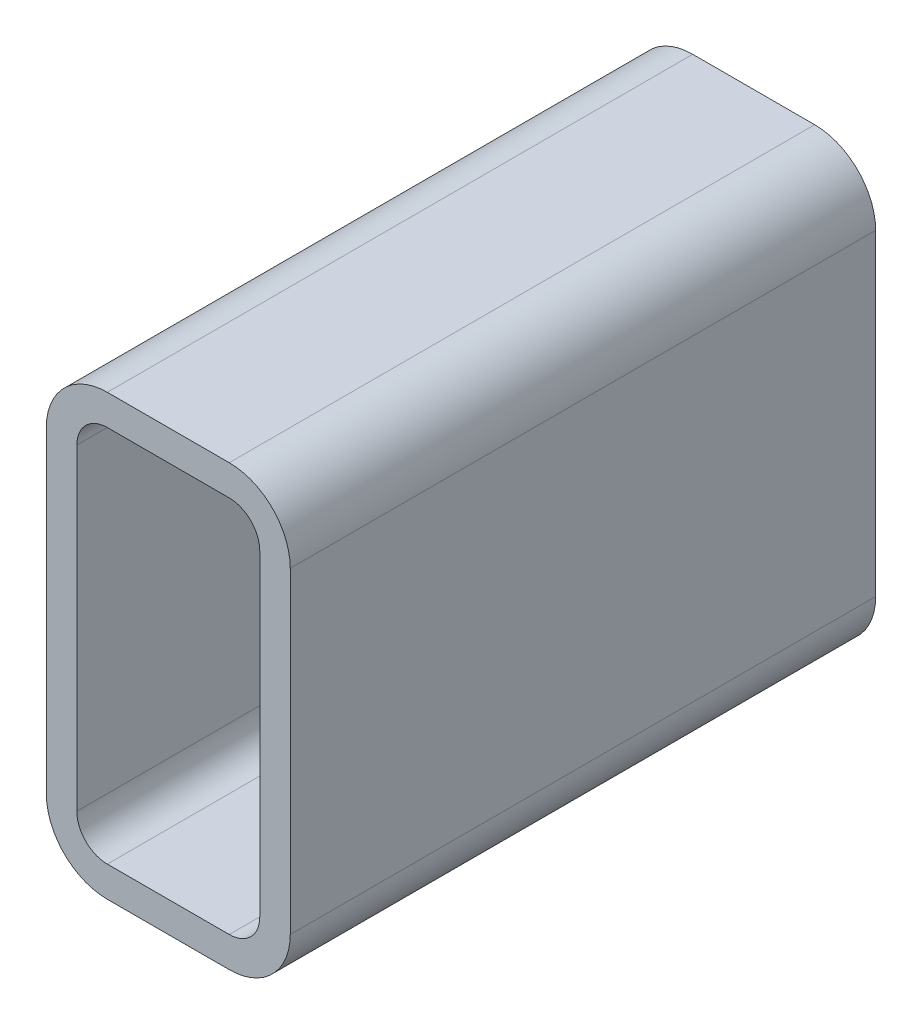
ISO-10303-21;
HEADER;
FILE_DESCRIPTION(('STEP AP214'),'2;1');
FILE_NAME('part.step','',(''),(''),'','','');
FILE_SCHEMA(('AUTOMOTIVE_DESIGN { 1 0 10303 214 1 1 1 1 }'));
ENDSEC;
DATA;
#1=APPLICATION_CONTEXT('core data for automotive mechanical design processes');
#2=APPLICATION_PROTOCOL_DEFINITION('international standard','automotive_design',2000,#1);
#3=PRODUCT_CONTEXT('',#1,'mechanical');
#4=PRODUCT('Part','Part','',(#3));
#5=PRODUCT_RELATED_PRODUCT_CATEGORY('part','',(#4));
#6=PRODUCT_DEFINITION_FORMATION('','',#4);
#7=PRODUCT_DEFINITION_CONTEXT('part definition',#1,'design');
#8=PRODUCT_DEFINITION('design','',#6,#7);
#9=PRODUCT_DEFINITION_SHAPE('','',#8);
#10=(LENGTH_UNIT() NAMED_UNIT(*) SI_UNIT(.MILLI.,.METRE.));
#11=(NAMED_UNIT(*) PLANE_ANGLE_UNIT() SI_UNIT($,.RADIAN.));
#12=(NAMED_UNIT(*) SI_UNIT($,.STERADIAN.) SOLID_ANGLE_UNIT());
#13=UNCERTAINTY_MEASURE_WITH_UNIT(LENGTH_MEASURE(1.E-05),#10,'distance_accuracy_value','');
#14=(GEOMETRIC_REPRESENTATION_CONTEXT(3) GLOBAL_UNCERTAINTY_ASSIGNED_CONTEXT((#13)) GLOBAL_UNIT_ASSIGNED_CONTEXT((#10,
#11,#12)) REPRESENTATION_CONTEXT('',''));
#15=CARTESIAN_POINT('',(0.,0.,0.));
#16=DIRECTION('',(0.,0.,1.));
#17=DIRECTION('',(1.,0.,0.));
#18=AXIS2_PLACEMENT_3D('',#15,#16,#17);
#19=CARTESIAN_POINT('',(32.6112396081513,198.793222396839,304.8));
#20=DIRECTION('',(0.,0.,1.));
#21=DIRECTION('',(1.,0.,0.));
#22=AXIS2_PLACEMENT_3D('',#19,#20,#21);
#23=PLANE('',#22);
#24=CARTESIAN_POINT('',(32.6112396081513,198.793222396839,304.8));
#25=DIRECTION('',(0.,0.,1.));
#26=DIRECTION('',(1.,0.,0.));
#27=AXIS2_PLACEMENT_3D('',#24,#25,#26);
#28=CIRCLE('',#27,31.75);
#29=CARTESIAN_POINT('',(32.6112396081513,230.543222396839,304.8));
#30=VERTEX_POINT('',#29);
#31=CARTESIAN_POINT('',(0.8612396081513,198.793222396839,304.8));
#32=VERTEX_POINT('',#31);
#33=EDGE_CURVE('E211',#30,#32,#28,.T.);
#34=ORIENTED_EDGE('',*,*,#33,.T.);
#35=DIRECTION('',(0.,-1.,0.));
#36=VECTOR('',#35,1.);
#37=CARTESIAN_POINT('',(0.8612396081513,198.793222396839,304.8));
#38=LINE('',#37,#36);
#39=CARTESIAN_POINT('',(0.8612396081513,33.6932223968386,304.8));
#40=VERTEX_POINT('',#39);
#41=EDGE_CURVE('E214',#32,#40,#38,.T.);
#42=ORIENTED_EDGE('',*,*,#41,.T.);
#43=CARTESIAN_POINT('',(32.6112396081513,33.6932223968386,304.8));
#44=DIRECTION('',(0.,0.,1.));
#45=DIRECTION('',(1.,0.,0.));
#46=AXIS2_PLACEMENT_3D('',#43,#44,#45);
#47=CIRCLE('',#46,31.75);
#48=CARTESIAN_POINT('',(32.6112396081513,1.94322239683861,304.8));
#49=VERTEX_POINT('',#48);
#50=EDGE_CURVE('E217',#40,#49,#47,.T.);
#51=ORIENTED_EDGE('',*,*,#50,.T.);
#52=DIRECTION('',(1.,0.,0.));
#53=VECTOR('',#52,1.);
#54=CARTESIAN_POINT('',(32.6112396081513,1.94322239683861,304.8));
#55=LINE('',#54,#53);
#56=CARTESIAN_POINT('',(96.1112396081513,1.94322239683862,304.8));
#57=VERTEX_POINT('',#56);
#58=EDGE_CURVE('E219',#49,#57,#55,.T.);
#59=ORIENTED_EDGE('',*,*,#58,.T.);
#60=CARTESIAN_POINT('',(96.1112396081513,33.6932223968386,304.8));
#61=DIRECTION('',(0.,0.,1.));
#62=DIRECTION('',(1.,0.,0.));
#63=AXIS2_PLACEMENT_3D('',#60,#61,#62);
#64=CIRCLE('',#63,31.75);
#65=CARTESIAN_POINT('',(127.861239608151,33.6932223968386,304.8));
#66=VERTEX_POINT('',#65);
#67=EDGE_CURVE('E221',#57,#66,#64,.T.);
#68=ORIENTED_EDGE('',*,*,#67,.T.);
#69=DIRECTION('',(0.,1.,0.));
#70=VECTOR('',#69,1.);
#71=CARTESIAN_POINT('',(127.861239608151,33.6932223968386,304.8));
#72=LINE('',#71,#70);
#73=CARTESIAN_POINT('',(127.861239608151,198.793222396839,304.8));
#74=VERTEX_POINT('',#73);
#75=EDGE_CURVE('E223',#66,#74,#72,.T.);
#76=ORIENTED_EDGE('',*,*,#75,.T.);
#77=CARTESIAN_POINT('',(96.1112396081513,198.793222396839,304.8));
#78=DIRECTION('',(0.,0.,1.));
#79=DIRECTION('',(1.,0.,0.));
#80=AXIS2_PLACEMENT_3D('',#77,#78,#79);
#81=CIRCLE('',#80,31.75);
#82=CARTESIAN_POINT('',(96.1112396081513,230.543222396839,304.8));
#83=VERTEX_POINT('',#82);
#84=EDGE_CURVE('E225',#74,#83,#81,.T.);
#85=ORIENTED_EDGE('',*,*,#84,.T.);
#86=DIRECTION('',(-1.,0.,0.));
#87=VECTOR('',#86,1.);
#88=CARTESIAN_POINT('',(96.1112396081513,230.543222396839,304.8));
#89=LINE('',#88,#87);
#90=EDGE_CURVE('E227',#83,#30,#89,.T.);
#91=ORIENTED_EDGE('',*,*,#90,.T.);
#92=EDGE_LOOP('',(#34,#42,#51,#59,#68,#76,#85,#91));
#93=FACE_BOUND('',#92,.T.);
#94=DIRECTION('',(0.,-1.,0.));
#95=VECTOR('',#94,1.);
#96=CARTESIAN_POINT('',(16.7362396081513,33.6932223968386,304.8));
#97=LINE('',#96,#95);
#98=CARTESIAN_POINT('',(16.7362396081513,198.793222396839,304.8));
#99=VERTEX_POINT('',#98);
#100=CARTESIAN_POINT('',(16.7362396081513,33.6932223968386,304.8));
#101=VERTEX_POINT('',#100);
#102=EDGE_CURVE('E154',#99,#101,#97,.T.);
#103=ORIENTED_EDGE('',*,*,#102,.F.);
#104=CARTESIAN_POINT('',(32.6112396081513,198.793222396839,304.8));
#105=DIRECTION('',(0.,0.,1.));
#106=DIRECTION('',(1.,0.,0.));
#107=AXIS2_PLACEMENT_3D('',#104,#105,#106);
#108=CIRCLE('',#107,15.875);
#109=CARTESIAN_POINT('',(32.6112396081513,214.668222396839,304.8));
#110=VERTEX_POINT('',#109);
#111=EDGE_CURVE('E146',#110,#99,#108,.T.);
#112=ORIENTED_EDGE('',*,*,#111,.F.);
#113=DIRECTION('',(-1.,0.,0.));
#114=VECTOR('',#113,1.);
#115=CARTESIAN_POINT('',(32.6112396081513,214.668222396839,304.8));
#116=LINE('',#115,#114);
#117=CARTESIAN_POINT('',(96.1112396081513,214.668222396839,304.8));
#118=VERTEX_POINT('',#117);
#119=EDGE_CURVE('E179',#118,#110,#116,.T.);
#120=ORIENTED_EDGE('',*,*,#119,.F.);
#121=CARTESIAN_POINT('',(96.1112396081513,198.793222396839,304.8));
#122=DIRECTION('',(0.,0.,1.));
#123=DIRECTION('',(1.,0.,0.));
#124=AXIS2_PLACEMENT_3D('',#121,#122,#123);
#125=CIRCLE('',#124,15.875);
#126=CARTESIAN_POINT('',(111.986239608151,198.793222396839,304.8));
#127=VERTEX_POINT('',#126);
#128=EDGE_CURVE('E177',#127,#118,#125,.T.);
#129=ORIENTED_EDGE('',*,*,#128,.F.);
#130=DIRECTION('',(0.,1.,0.));
#131=VECTOR('',#130,1.);
#132=CARTESIAN_POINT('',(111.986239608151,198.793222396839,304.8));
#133=LINE('',#132,#131);
#134=CARTESIAN_POINT('',(111.986239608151,33.6932223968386,304.8));
#135=VERTEX_POINT('',#134);
#136=EDGE_CURVE('E175',#135,#127,#133,.T.);
#137=ORIENTED_EDGE('',*,*,#136,.F.);
#138=CARTESIAN_POINT('',(96.1112396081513,33.6932223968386,304.8));
#139=DIRECTION('',(0.,0.,1.));
#140=DIRECTION('',(1.,0.,0.));
#141=AXIS2_PLACEMENT_3D('',#138,#139,#140);
#142=CIRCLE('',#141,15.875);
#143=CARTESIAN_POINT('',(96.1112396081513,17.8182223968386,304.8));
#144=VERTEX_POINT('',#143);
#145=EDGE_CURVE('E173',#144,#135,#142,.T.);
#146=ORIENTED_EDGE('',*,*,#145,.F.);
#147=DIRECTION('',(1.,0.,0.));
#148=VECTOR('',#147,1.);
#149=CARTESIAN_POINT('',(96.1112396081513,17.8182223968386,304.8));
#150=LINE('',#149,#148);
#151=CARTESIAN_POINT('',(32.6112396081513,17.8182223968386,304.8));
#152=VERTEX_POINT('',#151);
#153=EDGE_CURVE('E169',#152,#144,#150,.T.);
#154=ORIENTED_EDGE('',*,*,#153,.F.);
#155=CARTESIAN_POINT('',(32.6112396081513,33.6932223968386,304.8));
#156=DIRECTION('',(0.,0.,1.));
#157=DIRECTION('',(1.,0.,0.));
#158=AXIS2_PLACEMENT_3D('',#155,#156,#157);
#159=CIRCLE('',#158,15.875);
#160=EDGE_CURVE('E167',#101,#152,#159,.T.);
#161=ORIENTED_EDGE('',*,*,#160,.F.);
#162=EDGE_LOOP('',(#103,#112,#120,#129,#137,#146,#154,#161));
#163=FACE_BOUND('',#162,.T.);
#164=ADVANCED_FACE('F33',(#93,#163),#23,.T.);
#165=CARTESIAN_POINT('',(32.6112396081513,198.793222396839,0.));
#166=DIRECTION('',(0.,0.,1.));
#167=DIRECTION('',(1.,0.,0.));
#168=AXIS2_PLACEMENT_3D('',#165,#166,#167);
#169=PLANE('',#168);
#170=CARTESIAN_POINT('',(32.6112396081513,198.793222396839,0.));
#171=DIRECTION('',(0.,0.,1.));
#172=DIRECTION('',(1.,0.,0.));
#173=AXIS2_PLACEMENT_3D('',#170,#171,#172);
#174=CIRCLE('',#173,31.75);
#175=CARTESIAN_POINT('',(32.6112396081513,230.543222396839,0.));
#176=VERTEX_POINT('',#175);
#177=CARTESIAN_POINT('',(0.8612396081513,198.793222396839,0.));
#178=VERTEX_POINT('',#177);
#179=EDGE_CURVE('E162',#176,#178,#174,.T.);
#180=ORIENTED_EDGE('',*,*,#179,.F.);
#181=DIRECTION('',(-1.,0.,0.));
#182=VECTOR('',#181,1.);
#183=CARTESIAN_POINT('',(96.1112396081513,230.543222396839,0.));
#184=LINE('',#183,#182);
#185=CARTESIAN_POINT('',(96.1112396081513,230.543222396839,0.));
#186=VERTEX_POINT('',#185);
#187=EDGE_CURVE('E215',#186,#176,#184,.T.);
#188=ORIENTED_EDGE('',*,*,#187,.F.);
#189=CARTESIAN_POINT('',(96.1112396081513,198.793222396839,0.));
#190=DIRECTION('',(0.,0.,1.));
#191=DIRECTION('',(1.,0.,0.));
#192=AXIS2_PLACEMENT_3D('',#189,#190,#191);
#193=CIRCLE('',#192,31.75);
#194=CARTESIAN_POINT('',(127.861239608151,198.793222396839,0.));
#195=VERTEX_POINT('',#194);
#196=EDGE_CURVE('E242',#195,#186,#193,.T.);
#197=ORIENTED_EDGE('',*,*,#196,.F.);
#198=DIRECTION('',(0.,1.,0.));
#199=VECTOR('',#198,1.);
#200=CARTESIAN_POINT('',(127.861239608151,33.6932223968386,0.));
#201=LINE('',#200,#199);
#202=CARTESIAN_POINT('',(127.861239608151,33.6932223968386,0.));
#203=VERTEX_POINT('',#202);
#204=EDGE_CURVE('E240',#203,#195,#201,.T.);
#205=ORIENTED_EDGE('',*,*,#204,.F.);
#206=CARTESIAN_POINT('',(96.1112396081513,33.6932223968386,0.));
#207=DIRECTION('',(0.,0.,1.));
#208=DIRECTION('',(1.,0.,0.));
#209=AXIS2_PLACEMENT_3D('',#206,#207,#208);
#210=CIRCLE('',#209,31.75);
#211=CARTESIAN_POINT('',(96.1112396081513,1.94322239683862,0.));
#212=VERTEX_POINT('',#211);
#213=EDGE_CURVE('E238',#212,#203,#210,.T.);
#214=ORIENTED_EDGE('',*,*,#213,.F.);
#215=DIRECTION('',(1.,0.,0.));
#216=VECTOR('',#215,1.);
#217=CARTESIAN_POINT('',(32.6112396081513,1.94322239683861,0.));
#218=LINE('',#217,#216);
#219=CARTESIAN_POINT('',(32.6112396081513,1.94322239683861,0.));
#220=VERTEX_POINT('',#219);
#221=EDGE_CURVE('E236',#220,#212,#218,.T.);
#222=ORIENTED_EDGE('',*,*,#221,.F.);
#223=CARTESIAN_POINT('',(32.6112396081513,33.6932223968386,0.));
#224=DIRECTION('',(0.,0.,1.));
#225=DIRECTION('',(1.,0.,0.));
#226=AXIS2_PLACEMENT_3D('',#223,#224,#225);
#227=CIRCLE('',#226,31.75);
#228=CARTESIAN_POINT('',(0.8612396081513,33.6932223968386,0.));
#229=VERTEX_POINT('',#228);
#230=EDGE_CURVE('E234',#229,#220,#227,.T.);
#231=ORIENTED_EDGE('',*,*,#230,.F.);
#232=DIRECTION('',(0.,-1.,0.));
#233=VECTOR('',#232,1.);
#234=CARTESIAN_POINT('',(0.8612396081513,198.793222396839,0.));
#235=LINE('',#234,#233);
#236=EDGE_CURVE('E232',#178,#229,#235,.T.);
#237=ORIENTED_EDGE('',*,*,#236,.F.);
#238=EDGE_LOOP('',(#180,#188,#197,#205,#214,#222,#231,#237));
#239=FACE_BOUND('',#238,.T.);
#240=CARTESIAN_POINT('',(32.6112396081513,198.793222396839,0.));
#241=DIRECTION('',(0.,0.,1.));
#242=DIRECTION('',(1.,0.,0.));
#243=AXIS2_PLACEMENT_3D('',#240,#241,#242);
#244=CIRCLE('',#243,15.875);
#245=CARTESIAN_POINT('',(32.6112396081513,214.668222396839,0.));
#246=VERTEX_POINT('',#245);
#247=CARTESIAN_POINT('',(16.7362396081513,198.793222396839,0.));
#248=VERTEX_POINT('',#247);
#249=EDGE_CURVE('E56',#246,#248,#244,.T.);
#250=ORIENTED_EDGE('',*,*,#249,.T.);
#251=DIRECTION('',(0.,-1.,0.));
#252=VECTOR('',#251,1.);
#253=CARTESIAN_POINT('',(16.7362396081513,33.6932223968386,0.));
#254=LINE('',#253,#252);
#255=CARTESIAN_POINT('',(16.7362396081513,33.6932223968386,0.));
#256=VERTEX_POINT('',#255);
#257=EDGE_CURVE('E161',#248,#256,#254,.T.);
#258=ORIENTED_EDGE('',*,*,#257,.T.);
#259=CARTESIAN_POINT('',(32.6112396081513,33.6932223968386,0.));
#260=DIRECTION('',(0.,0.,1.));
#261=DIRECTION('',(1.,0.,0.));
#262=AXIS2_PLACEMENT_3D('',#259,#260,#261);
#263=CIRCLE('',#262,15.875);
#264=CARTESIAN_POINT('',(32.6112396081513,17.8182223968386,0.));
#265=VERTEX_POINT('',#264);
#266=EDGE_CURVE('E183',#256,#265,#263,.T.);
#267=ORIENTED_EDGE('',*,*,#266,.T.);
#268=DIRECTION('',(1.,0.,0.));
#269=VECTOR('',#268,1.);
#270=CARTESIAN_POINT('',(96.1112396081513,17.8182223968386,0.));
#271=LINE('',#270,#269);
#272=CARTESIAN_POINT('',(96.1112396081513,17.8182223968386,0.));
#273=VERTEX_POINT('',#272);
#274=EDGE_CURVE('E186',#265,#273,#271,.T.);
#275=ORIENTED_EDGE('',*,*,#274,.T.);
#276=CARTESIAN_POINT('',(96.1112396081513,33.6932223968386,0.));
#277=DIRECTION('',(0.,0.,1.));
#278=DIRECTION('',(1.,0.,0.));
#279=AXIS2_PLACEMENT_3D('',#276,#277,#278);
#280=CIRCLE('',#279,15.875);
#281=CARTESIAN_POINT('',(111.986239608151,33.6932223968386,0.));
#282=VERTEX_POINT('',#281);
#283=EDGE_CURVE('E189',#273,#282,#280,.T.);
#284=ORIENTED_EDGE('',*,*,#283,.T.);
#285=DIRECTION('',(0.,1.,0.));
#286=VECTOR('',#285,1.);
#287=CARTESIAN_POINT('',(111.986239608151,198.793222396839,0.));
#288=LINE('',#287,#286);
#289=CARTESIAN_POINT('',(111.986239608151,198.793222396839,0.));
#290=VERTEX_POINT('',#289);
#291=EDGE_CURVE('E192',#282,#290,#288,.T.);
#292=ORIENTED_EDGE('',*,*,#291,.T.);
#293=CARTESIAN_POINT('',(96.1112396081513,198.793222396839,0.));
#294=DIRECTION('',(0.,0.,1.));
#295=DIRECTION('',(1.,0.,0.));
#296=AXIS2_PLACEMENT_3D('',#293,#294,#295);
#297=CIRCLE('',#296,15.875);
#298=CARTESIAN_POINT('',(96.1112396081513,214.668222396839,0.));
#299=VERTEX_POINT('',#298);
#300=EDGE_CURVE('E195',#290,#299,#297,.T.);
#301=ORIENTED_EDGE('',*,*,#300,.T.);
#302=DIRECTION('',(-1.,0.,0.));
#303=VECTOR('',#302,1.);
#304=CARTESIAN_POINT('',(32.6112396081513,214.668222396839,0.));
#305=LINE('',#304,#303);
#306=EDGE_CURVE('E155',#299,#246,#305,.T.);
#307=ORIENTED_EDGE('',*,*,#306,.T.);
#308=EDGE_LOOP('',(#250,#258,#267,#275,#284,#292,#301,#307));
#309=FACE_BOUND('',#308,.T.);
#310=ADVANCED_FACE('F272',(#239,#309),#169,.F.);
#311=CARTESIAN_POINT('',(32.6112396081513,198.793222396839,304.8));
#312=DIRECTION('',(0.,0.,-1.));
#313=DIRECTION('',(-1.,0.,0.));
#314=AXIS2_PLACEMENT_3D('',#311,#312,#313);
#315=CYLINDRICAL_SURFACE('',#314,31.75);
#316=ORIENTED_EDGE('',*,*,#179,.T.);
#317=DIRECTION('',(0.,0.,-1.));
#318=VECTOR('',#317,1.);
#319=CARTESIAN_POINT('',(0.8612396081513,198.793222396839,304.8));
#320=LINE('',#319,#318);
#321=EDGE_CURVE('E11',#32,#178,#320,.T.);
#322=ORIENTED_EDGE('',*,*,#321,.F.);
#323=ORIENTED_EDGE('',*,*,#33,.F.);
#324=DIRECTION('',(0.,0.,-1.));
#325=VECTOR('',#324,1.);
#326=CARTESIAN_POINT('',(32.6112396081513,230.543222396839,304.8));
#327=LINE('',#326,#325);
#328=EDGE_CURVE('E229',#30,#176,#327,.T.);
#329=ORIENTED_EDGE('',*,*,#328,.T.);
#330=EDGE_LOOP('',(#316,#322,#323,#329));
#331=FACE_BOUND('',#330,.T.);
#332=ADVANCED_FACE('F35',(#331),#315,.T.);
#333=CARTESIAN_POINT('',(0.8612396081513,198.793222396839,304.8));
#334=DIRECTION('',(1.,0.,0.));
#335=DIRECTION('',(0.,0.,-1.));
#336=AXIS2_PLACEMENT_3D('',#333,#334,#335);
#337=PLANE('',#336);
#338=ORIENTED_EDGE('',*,*,#236,.T.);
#339=DIRECTION('',(0.,0.,-1.));
#340=VECTOR('',#339,1.);
#341=CARTESIAN_POINT('',(0.8612396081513,33.6932223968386,304.8));
#342=LINE('',#341,#340);
#343=EDGE_CURVE('E41',#40,#229,#342,.T.);
#344=ORIENTED_EDGE('',*,*,#343,.F.);
#345=ORIENTED_EDGE('',*,*,#41,.F.);
#346=ORIENTED_EDGE('',*,*,#321,.T.);
#347=EDGE_LOOP('',(#338,#344,#345,#346));
#348=FACE_BOUND('',#347,.T.);
#349=ADVANCED_FACE('F289',(#348),#337,.F.);
#350=CARTESIAN_POINT('',(32.6112396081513,33.6932223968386,304.8));
#351=DIRECTION('',(0.,0.,-1.));
#352=DIRECTION('',(-1.,0.,0.));
#353=AXIS2_PLACEMENT_3D('',#350,#351,#352);
#354=CYLINDRICAL_SURFACE('',#353,31.75);
#355=ORIENTED_EDGE('',*,*,#230,.T.);
#356=DIRECTION('',(0.,0.,-1.));
#357=VECTOR('',#356,1.);
#358=CARTESIAN_POINT('',(32.6112396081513,1.94322239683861,304.8));
#359=LINE('',#358,#357);
#360=EDGE_CURVE('E259',#49,#220,#359,.T.);
#361=ORIENTED_EDGE('',*,*,#360,.F.);
#362=ORIENTED_EDGE('',*,*,#50,.F.);
#363=ORIENTED_EDGE('',*,*,#343,.T.);
#364=EDGE_LOOP('',(#355,#361,#362,#363));
#365=FACE_BOUND('',#364,.T.);
#366=ADVANCED_FACE('F266',(#365),#354,.T.);
#367=CARTESIAN_POINT('',(32.6112396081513,1.94322239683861,304.8));
#368=DIRECTION('',(0.,1.,0.));
#369=DIRECTION('',(0.,0.,1.));
#370=AXIS2_PLACEMENT_3D('',#367,#368,#369);
#371=PLANE('',#370);
#372=ORIENTED_EDGE('',*,*,#221,.T.);
#373=DIRECTION('',(0.,0.,-1.));
#374=VECTOR('',#373,1.);
#375=CARTESIAN_POINT('',(96.1112396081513,1.94322239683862,304.8));
#376=LINE('',#375,#374);
#377=EDGE_CURVE('E256',#57,#212,#376,.T.);
#378=ORIENTED_EDGE('',*,*,#377,.F.);
#379=ORIENTED_EDGE('',*,*,#58,.F.);
#380=ORIENTED_EDGE('',*,*,#360,.T.);
#381=EDGE_LOOP('',(#372,#378,#379,#380));
#382=FACE_BOUND('',#381,.T.);
#383=ADVANCED_FACE('F278',(#382),#371,.F.);
#384=CARTESIAN_POINT('',(96.1112396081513,33.6932223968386,304.8));
#385=DIRECTION('',(0.,0.,-1.));
#386=DIRECTION('',(-1.,0.,0.));
#387=AXIS2_PLACEMENT_3D('',#384,#385,#386);
#388=CYLINDRICAL_SURFACE('',#387,31.75);
#389=ORIENTED_EDGE('',*,*,#213,.T.);
#390=DIRECTION('',(0.,0.,-1.));
#391=VECTOR('',#390,1.);
#392=CARTESIAN_POINT('',(127.861239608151,33.6932223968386,304.8));
#393=LINE('',#392,#391);
#394=EDGE_CURVE('E253',#66,#203,#393,.T.);
#395=ORIENTED_EDGE('',*,*,#394,.F.);
#396=ORIENTED_EDGE('',*,*,#67,.F.);
#397=ORIENTED_EDGE('',*,*,#377,.T.);
#398=EDGE_LOOP('',(#389,#395,#396,#397));
#399=FACE_BOUND('',#398,.T.);
#400=ADVANCED_FACE('F282',(#399),#388,.T.);
#401=CARTESIAN_POINT('',(127.861239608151,33.6932223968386,304.8));
#402=DIRECTION('',(-1.,0.,0.));
#403=DIRECTION('',(0.,0.,1.));
#404=AXIS2_PLACEMENT_3D('',#401,#402,#403);
#405=PLANE('',#404);
#406=ORIENTED_EDGE('',*,*,#204,.T.);
#407=DIRECTION('',(0.,0.,-1.));
#408=VECTOR('',#407,1.);
#409=CARTESIAN_POINT('',(127.861239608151,198.793222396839,304.8));
#410=LINE('',#409,#408);
#411=EDGE_CURVE('E250',#74,#195,#410,.T.);
#412=ORIENTED_EDGE('',*,*,#411,.F.);
#413=ORIENTED_EDGE('',*,*,#75,.F.);
#414=ORIENTED_EDGE('',*,*,#394,.T.);
#415=EDGE_LOOP('',(#406,#412,#413,#414));
#416=FACE_BOUND('',#415,.T.);
#417=ADVANCED_FACE('F302',(#416),#405,.F.);
#418=CARTESIAN_POINT('',(96.1112396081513,198.793222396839,304.8));
#419=DIRECTION('',(0.,0.,-1.));
#420=DIRECTION('',(-1.,0.,0.));
#421=AXIS2_PLACEMENT_3D('',#418,#419,#420);
#422=CYLINDRICAL_SURFACE('',#421,31.75);
#423=ORIENTED_EDGE('',*,*,#196,.T.);
#424=DIRECTION('',(0.,0.,-1.));
#425=VECTOR('',#424,1.);
#426=CARTESIAN_POINT('',(96.1112396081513,230.543222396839,304.8));
#427=LINE('',#426,#425);
#428=EDGE_CURVE('E247',#83,#186,#427,.T.);
#429=ORIENTED_EDGE('',*,*,#428,.F.);
#430=ORIENTED_EDGE('',*,*,#84,.F.);
#431=ORIENTED_EDGE('',*,*,#411,.T.);
#432=EDGE_LOOP('',(#423,#429,#430,#431));
#433=FACE_BOUND('',#432,.T.);
#434=ADVANCED_FACE('F300',(#433),#422,.T.);
#435=CARTESIAN_POINT('',(96.1112396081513,230.543222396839,304.8));
#436=DIRECTION('',(0.,-1.,0.));
#437=DIRECTION('',(0.,0.,-1.));
#438=AXIS2_PLACEMENT_3D('',#435,#436,#437);
#439=PLANE('',#438);
#440=ORIENTED_EDGE('',*,*,#187,.T.);
#441=ORIENTED_EDGE('',*,*,#328,.F.);
#442=ORIENTED_EDGE('',*,*,#90,.F.);
#443=ORIENTED_EDGE('',*,*,#428,.T.);
#444=EDGE_LOOP('',(#440,#441,#442,#443));
#445=FACE_BOUND('',#444,.T.);
#446=ADVANCED_FACE('F295',(#445),#439,.F.);
#447=CARTESIAN_POINT('',(32.6112396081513,198.793222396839,304.8));
#448=DIRECTION('',(0.,0.,-1.));
#449=DIRECTION('',(-1.,0.,0.));
#450=AXIS2_PLACEMENT_3D('',#447,#448,#449);
#451=CYLINDRICAL_SURFACE('',#450,15.875);
#452=ORIENTED_EDGE('',*,*,#249,.F.);
#453=DIRECTION('',(0.,0.,-1.));
#454=VECTOR('',#453,1.);
#455=CARTESIAN_POINT('',(32.6112396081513,214.668222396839,304.8));
#456=LINE('',#455,#454);
#457=EDGE_CURVE('E150',#110,#246,#456,.T.);
#458=ORIENTED_EDGE('',*,*,#457,.F.);
#459=ORIENTED_EDGE('',*,*,#111,.T.);
#460=DIRECTION('',(0.,0.,-1.));
#461=VECTOR('',#460,1.);
#462=CARTESIAN_POINT('',(16.7362396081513,198.793222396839,304.8));
#463=LINE('',#462,#461);
#464=EDGE_CURVE('E149',#99,#248,#463,.T.);
#465=ORIENTED_EDGE('',*,*,#464,.T.);
#466=EDGE_LOOP('',(#452,#458,#459,#465));
#467=FACE_BOUND('',#466,.T.);
#468=ADVANCED_FACE('F148',(#467),#451,.F.);
#469=CARTESIAN_POINT('',(16.7362396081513,33.6932223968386,304.8));
#470=DIRECTION('',(1.,0.,0.));
#471=DIRECTION('',(0.,0.,-1.));
#472=AXIS2_PLACEMENT_3D('',#469,#470,#471);
#473=PLANE('',#472);
#474=ORIENTED_EDGE('',*,*,#257,.F.);
#475=ORIENTED_EDGE('',*,*,#464,.F.);
#476=ORIENTED_EDGE('',*,*,#102,.T.);
#477=DIRECTION('',(0.,0.,-1.));
#478=VECTOR('',#477,1.);
#479=CARTESIAN_POINT('',(16.7362396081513,33.6932223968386,304.8));
#480=LINE('',#479,#478);
#481=EDGE_CURVE('E163',#101,#256,#480,.T.);
#482=ORIENTED_EDGE('',*,*,#481,.T.);
#483=EDGE_LOOP('',(#474,#475,#476,#482));
#484=FACE_BOUND('',#483,.T.);
#485=ADVANCED_FACE('F158',(#484),#473,.T.);
#486=CARTESIAN_POINT('',(32.6112396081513,33.6932223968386,304.8));
#487=DIRECTION('',(0.,0.,-1.));
#488=DIRECTION('',(-1.,0.,0.));
#489=AXIS2_PLACEMENT_3D('',#486,#487,#488);
#490=CYLINDRICAL_SURFACE('',#489,15.875);
#491=ORIENTED_EDGE('',*,*,#266,.F.);
#492=ORIENTED_EDGE('',*,*,#481,.F.);
#493=ORIENTED_EDGE('',*,*,#160,.T.);
#494=DIRECTION('',(0.,0.,-1.));
#495=VECTOR('',#494,1.);
#496=CARTESIAN_POINT('',(32.6112396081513,17.8182223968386,304.8));
#497=LINE('',#496,#495);
#498=EDGE_CURVE('E208',#152,#265,#497,.T.);
#499=ORIENTED_EDGE('',*,*,#498,.T.);
#500=EDGE_LOOP('',(#491,#492,#493,#499));
#501=FACE_BOUND('',#500,.T.);
#502=ADVANCED_FACE('F327',(#501),#490,.F.);
#503=CARTESIAN_POINT('',(96.1112396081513,17.8182223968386,304.8));
#504=DIRECTION('',(0.,1.,0.));
#505=DIRECTION('',(0.,0.,1.));
#506=AXIS2_PLACEMENT_3D('',#503,#504,#505);
#507=PLANE('',#506);
#508=ORIENTED_EDGE('',*,*,#274,.F.);
#509=ORIENTED_EDGE('',*,*,#498,.F.);
#510=ORIENTED_EDGE('',*,*,#153,.T.);
#511=DIRECTION('',(0.,0.,-1.));
#512=VECTOR('',#511,1.);
#513=CARTESIAN_POINT('',(96.1112396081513,17.8182223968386,304.8));
#514=LINE('',#513,#512);
#515=EDGE_CURVE('E206',#144,#273,#514,.T.);
#516=ORIENTED_EDGE('',*,*,#515,.T.);
#517=EDGE_LOOP('',(#508,#509,#510,#516));
#518=FACE_BOUND('',#517,.T.);
#519=ADVANCED_FACE('F331',(#518),#507,.T.);
#520=CARTESIAN_POINT('',(96.1112396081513,33.6932223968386,304.8));
#521=DIRECTION('',(0.,0.,-1.));
#522=DIRECTION('',(-1.,0.,0.));
#523=AXIS2_PLACEMENT_3D('',#520,#521,#522);
#524=CYLINDRICAL_SURFACE('',#523,15.875);
#525=ORIENTED_EDGE('',*,*,#283,.F.);
#526=ORIENTED_EDGE('',*,*,#515,.F.);
#527=ORIENTED_EDGE('',*,*,#145,.T.);
#528=DIRECTION('',(0.,0.,-1.));
#529=VECTOR('',#528,1.);
#530=CARTESIAN_POINT('',(111.986239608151,33.6932223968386,304.8));
#531=LINE('',#530,#529);
#532=EDGE_CURVE('E204',#135,#282,#531,.T.);
#533=ORIENTED_EDGE('',*,*,#532,.T.);
#534=EDGE_LOOP('',(#525,#526,#527,#533));
#535=FACE_BOUND('',#534,.T.);
#536=ADVANCED_FACE('F337',(#535),#524,.F.);
#537=CARTESIAN_POINT('',(111.986239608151,198.793222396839,304.8));
#538=DIRECTION('',(-1.,0.,0.));
#539=DIRECTION('',(0.,0.,1.));
#540=AXIS2_PLACEMENT_3D('',#537,#538,#539);
#541=PLANE('',#540);
#542=ORIENTED_EDGE('',*,*,#291,.F.);
#543=ORIENTED_EDGE('',*,*,#532,.F.);
#544=ORIENTED_EDGE('',*,*,#136,.T.);
#545=DIRECTION('',(0.,0.,-1.));
#546=VECTOR('',#545,1.);
#547=CARTESIAN_POINT('',(111.986239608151,198.793222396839,304.8));
#548=LINE('',#547,#546);
#549=EDGE_CURVE('E202',#127,#290,#548,.T.);
#550=ORIENTED_EDGE('',*,*,#549,.T.);
#551=EDGE_LOOP('',(#542,#543,#544,#550));
#552=FACE_BOUND('',#551,.T.);
#553=ADVANCED_FACE('F341',(#552),#541,.T.);
#554=CARTESIAN_POINT('',(96.1112396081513,198.793222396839,304.8));
#555=DIRECTION('',(0.,0.,-1.));
#556=DIRECTION('',(-1.,0.,0.));
#557=AXIS2_PLACEMENT_3D('',#554,#555,#556);
#558=CYLINDRICAL_SURFACE('',#557,15.875);
#559=ORIENTED_EDGE('',*,*,#300,.F.);
#560=ORIENTED_EDGE('',*,*,#549,.F.);
#561=ORIENTED_EDGE('',*,*,#128,.T.);
#562=DIRECTION('',(0.,0.,-1.));
#563=VECTOR('',#562,1.);
#564=CARTESIAN_POINT('',(96.1112396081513,214.668222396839,304.8));
#565=LINE('',#564,#563);
#566=EDGE_CURVE('E48',#118,#299,#565,.T.);
#567=ORIENTED_EDGE('',*,*,#566,.T.);
#568=EDGE_LOOP('',(#559,#560,#561,#567));
#569=FACE_BOUND('',#568,.T.);
#570=ADVANCED_FACE('F345',(#569),#558,.F.);
#571=CARTESIAN_POINT('',(32.6112396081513,214.668222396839,304.8));
#572=DIRECTION('',(0.,-1.,0.));
#573=DIRECTION('',(0.,0.,-1.));
#574=AXIS2_PLACEMENT_3D('',#571,#572,#573);
#575=PLANE('',#574);
#576=ORIENTED_EDGE('',*,*,#306,.F.);
#577=ORIENTED_EDGE('',*,*,#566,.F.);
#578=ORIENTED_EDGE('',*,*,#119,.T.);
#579=ORIENTED_EDGE('',*,*,#457,.T.);
#580=EDGE_LOOP('',(#576,#577,#578,#579));
#581=FACE_BOUND('',#580,.T.);
#582=ADVANCED_FACE('F349',(#581),#575,.T.);
#583=CLOSED_SHELL('',(#164,#310,#332,#349,#366,#383,#400,#417,#434,#446,#468,#485,#502,#519,
#536,#553,#570,#582));
#584=MANIFOLD_SOLID_BREP('B2',#583);
#585=ADVANCED_BREP_SHAPE_REPRESENTATION('',(#18,#584),#14);
#586=SHAPE_DEFINITION_REPRESENTATION(#9,#585);
ENDSEC;
END-ISO-10303-21;
